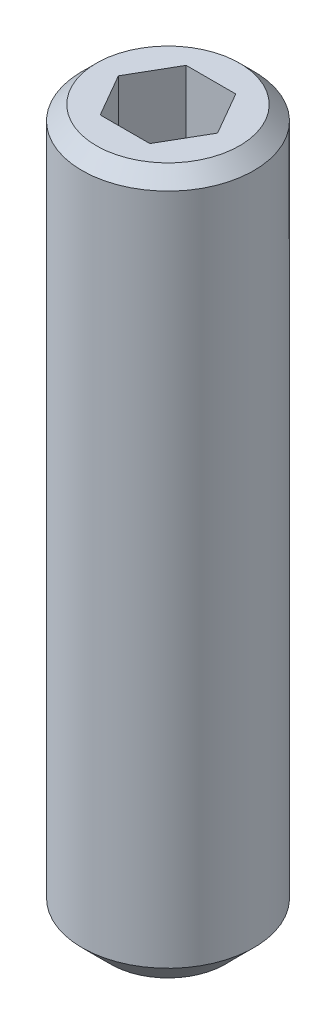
ISO-10303-21;
HEADER;
FILE_DESCRIPTION(('STEP AP214'),'2;1');
FILE_NAME('part.step','',(''),(''),'','','');
FILE_SCHEMA(('AUTOMOTIVE_DESIGN { 1 0 10303 214 1 1 1 1 }'));
ENDSEC;
DATA;
#1=APPLICATION_CONTEXT('core data for automotive mechanical design processes');
#2=APPLICATION_PROTOCOL_DEFINITION('international standard','automotive_design',2000,#1);
#3=PRODUCT_CONTEXT('',#1,'mechanical');
#4=PRODUCT('Part','Part','',(#3));
#5=PRODUCT_RELATED_PRODUCT_CATEGORY('part','',(#4));
#6=PRODUCT_DEFINITION_FORMATION('','',#4);
#7=PRODUCT_DEFINITION_CONTEXT('part definition',#1,'design');
#8=PRODUCT_DEFINITION('design','',#6,#7);
#9=PRODUCT_DEFINITION_SHAPE('','',#8);
#10=(LENGTH_UNIT() NAMED_UNIT(*) SI_UNIT(.MILLI.,.METRE.));
#11=(NAMED_UNIT(*) PLANE_ANGLE_UNIT() SI_UNIT($,.RADIAN.));
#12=(NAMED_UNIT(*) SI_UNIT($,.STERADIAN.) SOLID_ANGLE_UNIT());
#13=UNCERTAINTY_MEASURE_WITH_UNIT(LENGTH_MEASURE(1.E-05),#10,'distance_accuracy_value','');
#14=(GEOMETRIC_REPRESENTATION_CONTEXT(3) GLOBAL_UNCERTAINTY_ASSIGNED_CONTEXT((#13)) GLOBAL_UNIT_ASSIGNED_CONTEXT((#10,
#11,#12)) REPRESENTATION_CONTEXT('',''));
#15=CARTESIAN_POINT('',(0.,0.,0.));
#16=DIRECTION('',(0.,0.,1.));
#17=DIRECTION('',(1.,0.,0.));
#18=AXIS2_PLACEMENT_3D('',#15,#16,#17);
#19=CARTESIAN_POINT('',(0.,25.,0.));
#20=DIRECTION('',(0.,-1.,0.));
#21=DIRECTION('',(0.,0.,-1.));
#22=AXIS2_PLACEMENT_3D('',#19,#20,#21);
#23=CYLINDRICAL_SURFACE('',#22,3.);
#24=CARTESIAN_POINT('',(0.,24.5,0.));
#25=DIRECTION('',(0.,1.,0.));
#26=DIRECTION('',(0.,0.,1.));
#27=AXIS2_PLACEMENT_3D('',#24,#25,#26);
#28=CIRCLE('',#27,3.);
#29=CARTESIAN_POINT('',(0.,24.5,3.));
#30=VERTEX_POINT('',#29);
#31=EDGE_CURVE('E12',#30,#30,#28,.F.);
#32=ORIENTED_EDGE('',*,*,#31,.T.);
#33=EDGE_LOOP('',(#32));
#34=FACE_BOUND('',#33,.T.);
#35=CARTESIAN_POINT('',(0.,0.999999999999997,0.));
#36=DIRECTION('',(0.,1.,0.));
#37=DIRECTION('',(0.,0.,1.));
#38=AXIS2_PLACEMENT_3D('',#35,#36,#37);
#39=CIRCLE('',#38,3.);
#40=CARTESIAN_POINT('',(0.,0.999999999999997,3.));
#41=VERTEX_POINT('',#40);
#42=EDGE_CURVE('E124',#41,#41,#39,.F.);
#43=ORIENTED_EDGE('',*,*,#42,.F.);
#44=EDGE_LOOP('',(#43));
#45=FACE_BOUND('',#44,.T.);
#46=ADVANCED_FACE('F37',(#34,#45),#23,.T.);
#47=CARTESIAN_POINT('',(0.,25.,0.));
#48=DIRECTION('',(0.,1.,0.));
#49=DIRECTION('',(0.,0.,1.));
#50=AXIS2_PLACEMENT_3D('',#47,#48,#49);
#51=PLANE('',#50);
#52=CARTESIAN_POINT('',(0.,25.,0.));
#53=DIRECTION('',(0.,1.,0.));
#54=DIRECTION('',(0.,0.,1.));
#55=AXIS2_PLACEMENT_3D('',#52,#53,#54);
#56=CIRCLE('',#55,2.5);
#57=CARTESIAN_POINT('',(0.,25.,2.5));
#58=VERTEX_POINT('',#57);
#59=EDGE_CURVE('E45',#58,#58,#56,.T.);
#60=ORIENTED_EDGE('',*,*,#59,.T.);
#61=EDGE_LOOP('',(#60));
#62=FACE_BOUND('',#61,.T.);
#63=DIRECTION('',(-1.,0.,0.));
#64=VECTOR('',#63,1.);
#65=CARTESIAN_POINT('',(0.866025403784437,25.,1.5));
#66=LINE('',#65,#64);
#67=CARTESIAN_POINT('',(0.866025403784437,25.,1.5));
#68=VERTEX_POINT('',#67);
#69=CARTESIAN_POINT('',(-0.866025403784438,25.,1.5));
#70=VERTEX_POINT('',#69);
#71=EDGE_CURVE('E133',#68,#70,#66,.T.);
#72=ORIENTED_EDGE('',*,*,#71,.T.);
#73=DIRECTION('',(-0.499999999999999,0.,-0.866025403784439));
#74=VECTOR('',#73,1.);
#75=CARTESIAN_POINT('',(-0.866025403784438,25.,1.5));
#76=LINE('',#75,#74);
#77=CARTESIAN_POINT('',(-1.73205080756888,25.,0.));
#78=VERTEX_POINT('',#77);
#79=EDGE_CURVE('E52',#70,#78,#76,.T.);
#80=ORIENTED_EDGE('',*,*,#79,.T.);
#81=DIRECTION('',(0.5,0.,-0.866025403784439));
#82=VECTOR('',#81,1.);
#83=CARTESIAN_POINT('',(-1.73205080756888,25.,0.));
#84=LINE('',#83,#82);
#85=CARTESIAN_POINT('',(-0.866025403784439,25.,-1.5));
#86=VERTEX_POINT('',#85);
#87=EDGE_CURVE('E123',#78,#86,#84,.T.);
#88=ORIENTED_EDGE('',*,*,#87,.T.);
#89=DIRECTION('',(1.,0.,0.));
#90=VECTOR('',#89,1.);
#91=CARTESIAN_POINT('',(-0.866025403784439,25.,-1.5));
#92=LINE('',#91,#90);
#93=CARTESIAN_POINT('',(0.866025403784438,25.,-1.5));
#94=VERTEX_POINT('',#93);
#95=EDGE_CURVE('E127',#86,#94,#92,.T.);
#96=ORIENTED_EDGE('',*,*,#95,.T.);
#97=DIRECTION('',(0.5,0.,0.866025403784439));
#98=VECTOR('',#97,1.);
#99=CARTESIAN_POINT('',(0.866025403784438,25.,-1.5));
#100=LINE('',#99,#98);
#101=CARTESIAN_POINT('',(1.73205080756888,25.,0.));
#102=VERTEX_POINT('',#101);
#103=EDGE_CURVE('E130',#94,#102,#100,.T.);
#104=ORIENTED_EDGE('',*,*,#103,.T.);
#105=DIRECTION('',(-0.5,0.,0.866025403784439));
#106=VECTOR('',#105,1.);
#107=CARTESIAN_POINT('',(1.73205080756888,25.,0.));
#108=LINE('',#107,#106);
#109=EDGE_CURVE('E113',#102,#68,#108,.T.);
#110=ORIENTED_EDGE('',*,*,#109,.T.);
#111=EDGE_LOOP('',(#72,#80,#88,#96,#104,#110));
#112=FACE_BOUND('',#111,.T.);
#113=ADVANCED_FACE('F146',(#62,#112),#51,.T.);
#114=CARTESIAN_POINT('',(0.,25.,0.));
#115=DIRECTION('',(0.,-1.,0.));
#116=DIRECTION('',(0.,0.,-1.));
#117=AXIS2_PLACEMENT_3D('',#114,#115,#116);
#118=CONICAL_SURFACE('',#117,2.5,0.785398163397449);
#119=ORIENTED_EDGE('',*,*,#31,.F.);
#120=EDGE_LOOP('',(#119));
#121=FACE_BOUND('',#120,.T.);
#122=ORIENTED_EDGE('',*,*,#59,.F.);
#123=EDGE_LOOP('',(#122));
#124=FACE_BOUND('',#123,.T.);
#125=ADVANCED_FACE('F39',(#121,#124),#118,.T.);
#126=CARTESIAN_POINT('',(-0.866025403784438,21.5,1.5));
#127=DIRECTION('',(0.866025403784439,0.,-0.499999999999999));
#128=DIRECTION('',(-0.5,0.,-0.866025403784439));
#129=AXIS2_PLACEMENT_3D('',#126,#127,#128);
#130=PLANE('',#129);
#131=ORIENTED_EDGE('',*,*,#79,.F.);
#132=DIRECTION('',(0.,1.,0.));
#133=VECTOR('',#132,1.);
#134=CARTESIAN_POINT('',(-0.866025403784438,21.5,1.5));
#135=LINE('',#134,#133);
#136=CARTESIAN_POINT('',(-0.866025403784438,21.5,1.5));
#137=VERTEX_POINT('',#136);
#138=EDGE_CURVE('E118',#137,#70,#135,.T.);
#139=ORIENTED_EDGE('',*,*,#138,.F.);
#140=DIRECTION('',(-0.499999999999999,0.,-0.866025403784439));
#141=VECTOR('',#140,1.);
#142=CARTESIAN_POINT('',(-0.866025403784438,21.5,1.5));
#143=LINE('',#142,#141);
#144=CARTESIAN_POINT('',(-1.73205080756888,21.5,0.));
#145=VERTEX_POINT('',#144);
#146=EDGE_CURVE('E136',#137,#145,#143,.T.);
#147=ORIENTED_EDGE('',*,*,#146,.T.);
#148=DIRECTION('',(0.,1.,0.));
#149=VECTOR('',#148,1.);
#150=CARTESIAN_POINT('',(-1.73205080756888,21.5,0.));
#151=LINE('',#150,#149);
#152=EDGE_CURVE('E142',#145,#78,#151,.T.);
#153=ORIENTED_EDGE('',*,*,#152,.T.);
#154=EDGE_LOOP('',(#131,#139,#147,#153));
#155=FACE_BOUND('',#154,.T.);
#156=ADVANCED_FACE('F150',(#155),#130,.T.);
#157=CARTESIAN_POINT('',(-1.73205080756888,21.5,0.));
#158=DIRECTION('',(0.866025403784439,0.,0.5));
#159=DIRECTION('',(0.5,0.,-0.866025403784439));
#160=AXIS2_PLACEMENT_3D('',#157,#158,#159);
#161=PLANE('',#160);
#162=ORIENTED_EDGE('',*,*,#87,.F.);
#163=ORIENTED_EDGE('',*,*,#152,.F.);
#164=DIRECTION('',(0.5,0.,-0.866025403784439));
#165=VECTOR('',#164,1.);
#166=CARTESIAN_POINT('',(-1.73205080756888,21.5,0.));
#167=LINE('',#166,#165);
#168=CARTESIAN_POINT('',(-0.866025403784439,21.5,-1.5));
#169=VERTEX_POINT('',#168);
#170=EDGE_CURVE('E91',#145,#169,#167,.T.);
#171=ORIENTED_EDGE('',*,*,#170,.T.);
#172=DIRECTION('',(0.,1.,0.));
#173=VECTOR('',#172,1.);
#174=CARTESIAN_POINT('',(-0.866025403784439,21.5,-1.5));
#175=LINE('',#174,#173);
#176=EDGE_CURVE('E140',#169,#86,#175,.T.);
#177=ORIENTED_EDGE('',*,*,#176,.T.);
#178=EDGE_LOOP('',(#162,#163,#171,#177));
#179=FACE_BOUND('',#178,.T.);
#180=ADVANCED_FACE('F156',(#179),#161,.T.);
#181=CARTESIAN_POINT('',(-0.866025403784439,21.5,-1.5));
#182=DIRECTION('',(0.,0.,1.));
#183=DIRECTION('',(1.,0.,0.));
#184=AXIS2_PLACEMENT_3D('',#181,#182,#183);
#185=PLANE('',#184);
#186=ORIENTED_EDGE('',*,*,#95,.F.);
#187=ORIENTED_EDGE('',*,*,#176,.F.);
#188=DIRECTION('',(1.,0.,0.));
#189=VECTOR('',#188,1.);
#190=CARTESIAN_POINT('',(-0.866025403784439,21.5,-1.5));
#191=LINE('',#190,#189);
#192=CARTESIAN_POINT('',(0.866025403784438,21.5,-1.5));
#193=VERTEX_POINT('',#192);
#194=EDGE_CURVE('E109',#169,#193,#191,.T.);
#195=ORIENTED_EDGE('',*,*,#194,.T.);
#196=DIRECTION('',(0.,1.,0.));
#197=VECTOR('',#196,1.);
#198=CARTESIAN_POINT('',(0.866025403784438,21.5,-1.5));
#199=LINE('',#198,#197);
#200=EDGE_CURVE('E106',#193,#94,#199,.T.);
#201=ORIENTED_EDGE('',*,*,#200,.T.);
#202=EDGE_LOOP('',(#186,#187,#195,#201));
#203=FACE_BOUND('',#202,.T.);
#204=ADVANCED_FACE('F173',(#203),#185,.T.);
#205=CARTESIAN_POINT('',(0.866025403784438,21.5,-1.5));
#206=DIRECTION('',(-0.866025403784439,0.,0.5));
#207=DIRECTION('',(0.5,0.,0.866025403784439));
#208=AXIS2_PLACEMENT_3D('',#205,#206,#207);
#209=PLANE('',#208);
#210=ORIENTED_EDGE('',*,*,#103,.F.);
#211=ORIENTED_EDGE('',*,*,#200,.F.);
#212=DIRECTION('',(0.5,0.,0.866025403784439));
#213=VECTOR('',#212,1.);
#214=CARTESIAN_POINT('',(0.866025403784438,21.5,-1.5));
#215=LINE('',#214,#213);
#216=CARTESIAN_POINT('',(1.73205080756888,21.5,0.));
#217=VERTEX_POINT('',#216);
#218=EDGE_CURVE('E101',#193,#217,#215,.T.);
#219=ORIENTED_EDGE('',*,*,#218,.T.);
#220=DIRECTION('',(0.,1.,0.));
#221=VECTOR('',#220,1.);
#222=CARTESIAN_POINT('',(1.73205080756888,21.5,0.));
#223=LINE('',#222,#221);
#224=EDGE_CURVE('E105',#217,#102,#223,.T.);
#225=ORIENTED_EDGE('',*,*,#224,.T.);
#226=EDGE_LOOP('',(#210,#211,#219,#225));
#227=FACE_BOUND('',#226,.T.);
#228=ADVANCED_FACE('F104',(#227),#209,.T.);
#229=CARTESIAN_POINT('',(1.73205080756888,21.5,0.));
#230=DIRECTION('',(-0.866025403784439,0.,-0.5));
#231=DIRECTION('',(-0.5,0.,0.866025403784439));
#232=AXIS2_PLACEMENT_3D('',#229,#230,#231);
#233=PLANE('',#232);
#234=ORIENTED_EDGE('',*,*,#109,.F.);
#235=ORIENTED_EDGE('',*,*,#224,.F.);
#236=DIRECTION('',(-0.5,0.,0.866025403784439));
#237=VECTOR('',#236,1.);
#238=CARTESIAN_POINT('',(1.73205080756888,21.5,0.));
#239=LINE('',#238,#237);
#240=CARTESIAN_POINT('',(0.866025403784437,21.5,1.5));
#241=VERTEX_POINT('',#240);
#242=EDGE_CURVE('E108',#217,#241,#239,.T.);
#243=ORIENTED_EDGE('',*,*,#242,.T.);
#244=DIRECTION('',(0.,1.,0.));
#245=VECTOR('',#244,1.);
#246=CARTESIAN_POINT('',(0.866025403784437,21.5,1.5));
#247=LINE('',#246,#245);
#248=EDGE_CURVE('E82',#241,#68,#247,.T.);
#249=ORIENTED_EDGE('',*,*,#248,.T.);
#250=EDGE_LOOP('',(#234,#235,#243,#249));
#251=FACE_BOUND('',#250,.T.);
#252=ADVANCED_FACE('F111',(#251),#233,.T.);
#253=CARTESIAN_POINT('',(0.866025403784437,21.5,1.5));
#254=DIRECTION('',(0.,0.,-1.));
#255=DIRECTION('',(-1.,0.,0.));
#256=AXIS2_PLACEMENT_3D('',#253,#254,#255);
#257=PLANE('',#256);
#258=ORIENTED_EDGE('',*,*,#71,.F.);
#259=ORIENTED_EDGE('',*,*,#248,.F.);
#260=DIRECTION('',(-1.,0.,0.));
#261=VECTOR('',#260,1.);
#262=CARTESIAN_POINT('',(0.866025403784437,21.5,1.5));
#263=LINE('',#262,#261);
#264=EDGE_CURVE('E60',#241,#137,#263,.T.);
#265=ORIENTED_EDGE('',*,*,#264,.T.);
#266=ORIENTED_EDGE('',*,*,#138,.T.);
#267=EDGE_LOOP('',(#258,#259,#265,#266));
#268=FACE_BOUND('',#267,.T.);
#269=ADVANCED_FACE('F182',(#268),#257,.T.);
#270=CARTESIAN_POINT('',(-2.59807621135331,21.5,-1.5));
#271=DIRECTION('',(0.,-1.,0.));
#272=DIRECTION('',(0.,0.,-1.));
#273=AXIS2_PLACEMENT_3D('',#270,#271,#272);
#274=PLANE('',#273);
#275=ORIENTED_EDGE('',*,*,#146,.F.);
#276=ORIENTED_EDGE('',*,*,#264,.F.);
#277=ORIENTED_EDGE('',*,*,#242,.F.);
#278=ORIENTED_EDGE('',*,*,#218,.F.);
#279=ORIENTED_EDGE('',*,*,#194,.F.);
#280=ORIENTED_EDGE('',*,*,#170,.F.);
#281=EDGE_LOOP('',(#275,#276,#277,#278,#279,#280));
#282=FACE_BOUND('',#281,.T.);
#283=ADVANCED_FACE('F116',(#282),#274,.F.);
#284=CARTESIAN_POINT('',(0.,0.,0.));
#285=DIRECTION('',(0.,1.,0.));
#286=DIRECTION('',(0.,0.,-1.));
#287=AXIS2_PLACEMENT_3D('',#284,#285,#286);
#288=CONICAL_SURFACE('',#287,2.,0.78539816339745);
#289=CARTESIAN_POINT('',(0.,0.,0.));
#290=DIRECTION('',(0.,-1.,0.));
#291=DIRECTION('',(0.,0.,-1.));
#292=AXIS2_PLACEMENT_3D('',#289,#290,#291);
#293=CIRCLE('',#292,2.);
#294=CARTESIAN_POINT('',(0.,0.,-2.));
#295=VERTEX_POINT('',#294);
#296=EDGE_CURVE('E194',#295,#295,#293,.T.);
#297=ORIENTED_EDGE('',*,*,#296,.F.);
#298=EDGE_LOOP('',(#297));
#299=FACE_BOUND('',#298,.T.);
#300=ORIENTED_EDGE('',*,*,#42,.T.);
#301=EDGE_LOOP('',(#300));
#302=FACE_BOUND('',#301,.T.);
#303=ADVANCED_FACE('F168',(#299,#302),#288,.T.);
#304=CARTESIAN_POINT('',(0.,0.,0.));
#305=DIRECTION('',(0.,1.,0.));
#306=DIRECTION('',(0.,0.,1.));
#307=AXIS2_PLACEMENT_3D('',#304,#305,#306);
#308=PLANE('',#307);
#309=ORIENTED_EDGE('',*,*,#296,.T.);
#310=EDGE_LOOP('',(#309));
#311=FACE_BOUND('',#310,.T.);
#312=ADVANCED_FACE('F166',(#311),#308,.F.);
#313=CLOSED_SHELL('',(#46,#113,#125,#156,#180,#204,#228,#252,#269,#283,#303,#312));
#314=MANIFOLD_SOLID_BREP('B2',#313);
#315=ADVANCED_BREP_SHAPE_REPRESENTATION('',(#18,#314),#14);
#316=SHAPE_DEFINITION_REPRESENTATION(#9,#315);
ENDSEC;
END-ISO-10303-21;
